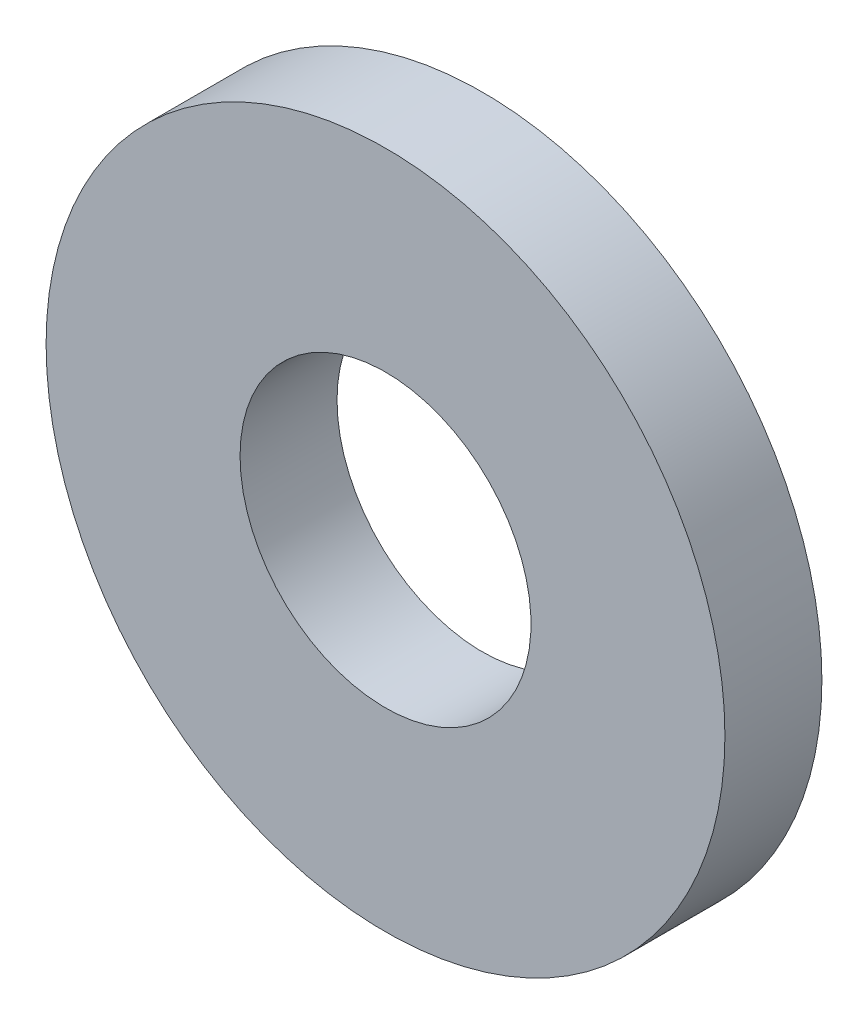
ISO-10303-21;
HEADER;
FILE_DESCRIPTION(('STEP AP214'),'2;1');
FILE_NAME('part.step','',(''),(''),'','','');
FILE_SCHEMA(('AUTOMOTIVE_DESIGN { 1 0 10303 214 1 1 1 1 }'));
ENDSEC;
DATA;
#1=APPLICATION_CONTEXT('core data for automotive mechanical design processes');
#2=APPLICATION_PROTOCOL_DEFINITION('international standard','automotive_design',2000,#1);
#3=PRODUCT_CONTEXT('',#1,'mechanical');
#4=PRODUCT('Part','Part','',(#3));
#5=PRODUCT_RELATED_PRODUCT_CATEGORY('part','',(#4));
#6=PRODUCT_DEFINITION_FORMATION('','',#4);
#7=PRODUCT_DEFINITION_CONTEXT('part definition',#1,'design');
#8=PRODUCT_DEFINITION('design','',#6,#7);
#9=PRODUCT_DEFINITION_SHAPE('','',#8);
#10=(LENGTH_UNIT() NAMED_UNIT(*) SI_UNIT(.MILLI.,.METRE.));
#11=(NAMED_UNIT(*) PLANE_ANGLE_UNIT() SI_UNIT($,.RADIAN.));
#12=(NAMED_UNIT(*) SI_UNIT($,.STERADIAN.) SOLID_ANGLE_UNIT());
#13=UNCERTAINTY_MEASURE_WITH_UNIT(LENGTH_MEASURE(1.E-05),#10,'distance_accuracy_value','');
#14=(GEOMETRIC_REPRESENTATION_CONTEXT(3) GLOBAL_UNCERTAINTY_ASSIGNED_CONTEXT((#13)) GLOBAL_UNIT_ASSIGNED_CONTEXT((#10,
#11,#12)) REPRESENTATION_CONTEXT('',''));
#15=CARTESIAN_POINT('',(0.,0.,0.));
#16=DIRECTION('',(0.,0.,1.));
#17=DIRECTION('',(1.,0.,0.));
#18=AXIS2_PLACEMENT_3D('',#15,#16,#17);
#19=CARTESIAN_POINT('',(7.,-7.,-2.));
#20=DIRECTION('',(0.,0.,-1.));
#21=DIRECTION('',(-1.,0.,0.));
#22=AXIS2_PLACEMENT_3D('',#19,#20,#21);
#23=PLANE('',#22);
#24=CARTESIAN_POINT('',(0.,0.,-2.));
#25=DIRECTION('',(0.,0.,-1.));
#26=DIRECTION('',(-1.,0.,0.));
#27=AXIS2_PLACEMENT_3D('',#24,#25,#26);
#28=CIRCLE('',#27,3.);
#29=CARTESIAN_POINT('',(-3.,0.,-2.));
#30=VERTEX_POINT('',#29);
#31=EDGE_CURVE('E26',#30,#30,#28,.T.);
#32=ORIENTED_EDGE('',*,*,#31,.F.);
#33=EDGE_LOOP('',(#32));
#34=FACE_BOUND('',#33,.T.);
#35=CARTESIAN_POINT('',(0.,0.,-2.));
#36=DIRECTION('',(0.,0.,1.));
#37=DIRECTION('',(1.,0.,0.));
#38=AXIS2_PLACEMENT_3D('',#35,#36,#37);
#39=CIRCLE('',#38,7.);
#40=CARTESIAN_POINT('',(7.,0.,-2.));
#41=VERTEX_POINT('',#40);
#42=EDGE_CURVE('E35',#41,#41,#39,.F.);
#43=ORIENTED_EDGE('',*,*,#42,.T.);
#44=EDGE_LOOP('',(#43));
#45=FACE_BOUND('',#44,.T.);
#46=ADVANCED_FACE('F13',(#34,#45),#23,.T.);
#47=CARTESIAN_POINT('',(0.,0.,-2.));
#48=DIRECTION('',(0.,0.,1.));
#49=DIRECTION('',(1.,0.,0.));
#50=AXIS2_PLACEMENT_3D('',#47,#48,#49);
#51=CYLINDRICAL_SURFACE('',#50,7.);
#52=ORIENTED_EDGE('',*,*,#42,.F.);
#53=EDGE_LOOP('',(#52));
#54=FACE_BOUND('',#53,.T.);
#55=CARTESIAN_POINT('',(0.,0.,0.));
#56=DIRECTION('',(0.,0.,1.));
#57=DIRECTION('',(1.,0.,0.));
#58=AXIS2_PLACEMENT_3D('',#55,#56,#57);
#59=CIRCLE('',#58,7.);
#60=CARTESIAN_POINT('',(7.,0.,0.));
#61=VERTEX_POINT('',#60);
#62=EDGE_CURVE('E21',#61,#61,#59,.T.);
#63=ORIENTED_EDGE('',*,*,#62,.F.);
#64=EDGE_LOOP('',(#63));
#65=FACE_BOUND('',#64,.T.);
#66=ADVANCED_FACE('F41',(#54,#65),#51,.T.);
#67=CARTESIAN_POINT('',(0.,0.,0.));
#68=DIRECTION('',(0.,0.,-1.));
#69=DIRECTION('',(-1.,0.,0.));
#70=AXIS2_PLACEMENT_3D('',#67,#68,#69);
#71=CYLINDRICAL_SURFACE('',#70,3.);
#72=ORIENTED_EDGE('',*,*,#31,.T.);
#73=EDGE_LOOP('',(#72));
#74=FACE_BOUND('',#73,.T.);
#75=CARTESIAN_POINT('',(0.,0.,0.));
#76=DIRECTION('',(0.,0.,-1.));
#77=DIRECTION('',(-1.,0.,0.));
#78=AXIS2_PLACEMENT_3D('',#75,#76,#77);
#79=CIRCLE('',#78,3.);
#80=CARTESIAN_POINT('',(-3.,0.,0.));
#81=VERTEX_POINT('',#80);
#82=EDGE_CURVE('E9',#81,#81,#79,.T.);
#83=ORIENTED_EDGE('',*,*,#82,.F.);
#84=EDGE_LOOP('',(#83));
#85=FACE_BOUND('',#84,.T.);
#86=ADVANCED_FACE('F44',(#74,#85),#71,.F.);
#87=CARTESIAN_POINT('',(-7.,-7.,0.));
#88=DIRECTION('',(0.,0.,1.));
#89=DIRECTION('',(1.,0.,0.));
#90=AXIS2_PLACEMENT_3D('',#87,#88,#89);
#91=PLANE('',#90);
#92=ORIENTED_EDGE('',*,*,#82,.T.);
#93=EDGE_LOOP('',(#92));
#94=FACE_BOUND('',#93,.T.);
#95=ORIENTED_EDGE('',*,*,#62,.T.);
#96=EDGE_LOOP('',(#95));
#97=FACE_BOUND('',#96,.T.);
#98=ADVANCED_FACE('F15',(#94,#97),#91,.T.);
#99=CLOSED_SHELL('',(#46,#66,#86,#98));
#100=MANIFOLD_SOLID_BREP('B1',#99);
#101=ADVANCED_BREP_SHAPE_REPRESENTATION('',(#18,#100),#14);
#102=SHAPE_DEFINITION_REPRESENTATION(#9,#101);
ENDSEC;
END-ISO-10303-21;
